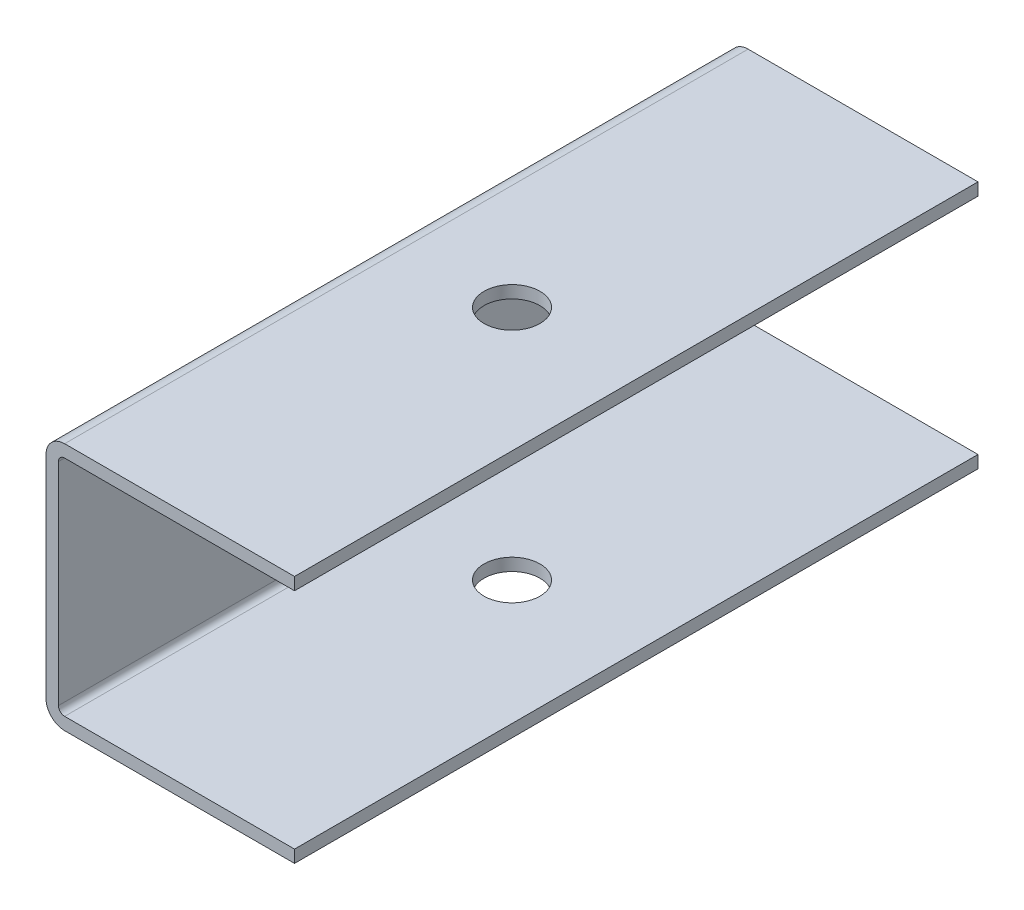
ISO-10303-21;
HEADER;
FILE_DESCRIPTION(('STEP AP214'),'2;1');
FILE_NAME('part.step','',(''),(''),'','','');
FILE_SCHEMA(('AUTOMOTIVE_DESIGN { 1 0 10303 214 1 1 1 1 }'));
ENDSEC;
DATA;
#1=APPLICATION_CONTEXT('core data for automotive mechanical design processes');
#2=APPLICATION_PROTOCOL_DEFINITION('international standard','automotive_design',2000,#1);
#3=PRODUCT_CONTEXT('',#1,'mechanical');
#4=PRODUCT('Part','Part','',(#3));
#5=PRODUCT_RELATED_PRODUCT_CATEGORY('part','',(#4));
#6=PRODUCT_DEFINITION_FORMATION('','',#4);
#7=PRODUCT_DEFINITION_CONTEXT('part definition',#1,'design');
#8=PRODUCT_DEFINITION('design','',#6,#7);
#9=PRODUCT_DEFINITION_SHAPE('','',#8);
#10=(LENGTH_UNIT() NAMED_UNIT(*) SI_UNIT(.MILLI.,.METRE.));
#11=(NAMED_UNIT(*) PLANE_ANGLE_UNIT() SI_UNIT($,.RADIAN.));
#12=(NAMED_UNIT(*) SI_UNIT($,.STERADIAN.) SOLID_ANGLE_UNIT());
#13=UNCERTAINTY_MEASURE_WITH_UNIT(LENGTH_MEASURE(1.E-05),#10,'distance_accuracy_value','');
#14=(GEOMETRIC_REPRESENTATION_CONTEXT(3) GLOBAL_UNCERTAINTY_ASSIGNED_CONTEXT((#13)) GLOBAL_UNIT_ASSIGNED_CONTEXT((#10,
#11,#12)) REPRESENTATION_CONTEXT('',''));
#15=CARTESIAN_POINT('',(0.,0.,0.));
#16=DIRECTION('',(0.,0.,1.));
#17=DIRECTION('',(1.,0.,0.));
#18=AXIS2_PLACEMENT_3D('',#15,#16,#17);
#19=CARTESIAN_POINT('',(40.,-38.,110.));
#20=DIRECTION('',(-1.,0.,0.));
#21=DIRECTION('',(0.,0.,1.));
#22=AXIS2_PLACEMENT_3D('',#19,#20,#21);
#23=PLANE('',#22);
#24=DIRECTION('',(0.,1.,0.));
#25=VECTOR('',#24,1.);
#26=CARTESIAN_POINT('',(40.,-38.,0.));
#27=LINE('',#26,#25);
#28=CARTESIAN_POINT('',(40.,-40.,0.));
#29=VERTEX_POINT('',#28);
#30=CARTESIAN_POINT('',(40.,-38.,0.));
#31=VERTEX_POINT('',#30);
#32=EDGE_CURVE('E121',#29,#31,#27,.T.);
#33=ORIENTED_EDGE('',*,*,#32,.T.);
#34=DIRECTION('',(0.,0.,-1.));
#35=VECTOR('',#34,1.);
#36=CARTESIAN_POINT('',(40.,-38.,110.));
#37=LINE('',#36,#35);
#38=CARTESIAN_POINT('',(40.,-38.,110.));
#39=VERTEX_POINT('',#38);
#40=EDGE_CURVE('E11',#39,#31,#37,.T.);
#41=ORIENTED_EDGE('',*,*,#40,.F.);
#42=DIRECTION('',(0.,1.,0.));
#43=VECTOR('',#42,1.);
#44=CARTESIAN_POINT('',(40.,-38.,110.));
#45=LINE('',#44,#43);
#46=CARTESIAN_POINT('',(40.,-40.,110.));
#47=VERTEX_POINT('',#46);
#48=EDGE_CURVE('E161',#47,#39,#45,.T.);
#49=ORIENTED_EDGE('',*,*,#48,.F.);
#50=DIRECTION('',(0.,0.,-1.));
#51=VECTOR('',#50,1.);
#52=CARTESIAN_POINT('',(40.,-40.,110.));
#53=LINE('',#52,#51);
#54=EDGE_CURVE('E134',#47,#29,#53,.T.);
#55=ORIENTED_EDGE('',*,*,#54,.T.);
#56=EDGE_LOOP('',(#33,#41,#49,#55));
#57=FACE_BOUND('',#56,.T.);
#58=ADVANCED_FACE('F29',(#57),#23,.F.);
#59=CARTESIAN_POINT('',(3.,-38.,110.));
#60=DIRECTION('',(0.,-1.,0.));
#61=DIRECTION('',(0.,0.,-1.));
#62=AXIS2_PLACEMENT_3D('',#59,#60,#61);
#63=PLANE('',#62);
#64=CARTESIAN_POINT('',(20.,-38.,55.));
#65=DIRECTION('',(0.,-1.,0.));
#66=DIRECTION('',(0.,0.,-1.));
#67=AXIS2_PLACEMENT_3D('',#64,#65,#66);
#68=CIRCLE('',#67,4.50000000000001);
#69=CARTESIAN_POINT('',(20.,-38.,50.5));
#70=VERTEX_POINT('',#69);
#71=EDGE_CURVE('E135',#70,#70,#68,.T.);
#72=ORIENTED_EDGE('',*,*,#71,.T.);
#73=EDGE_LOOP('',(#72));
#74=FACE_BOUND('',#73,.T.);
#75=DIRECTION('',(-1.,0.,0.));
#76=VECTOR('',#75,1.);
#77=CARTESIAN_POINT('',(3.,-38.,0.));
#78=LINE('',#77,#76);
#79=CARTESIAN_POINT('',(3.,-38.,0.));
#80=VERTEX_POINT('',#79);
#81=EDGE_CURVE('E117',#31,#80,#78,.T.);
#82=ORIENTED_EDGE('',*,*,#81,.T.);
#83=DIRECTION('',(0.,0.,-1.));
#84=VECTOR('',#83,1.);
#85=CARTESIAN_POINT('',(3.,-38.,110.));
#86=LINE('',#85,#84);
#87=CARTESIAN_POINT('',(3.,-38.,110.));
#88=VERTEX_POINT('',#87);
#89=EDGE_CURVE('E36',#88,#80,#86,.T.);
#90=ORIENTED_EDGE('',*,*,#89,.F.);
#91=DIRECTION('',(-1.,0.,0.));
#92=VECTOR('',#91,1.);
#93=CARTESIAN_POINT('',(3.,-38.,110.));
#94=LINE('',#93,#92);
#95=EDGE_CURVE('E130',#39,#88,#94,.T.);
#96=ORIENTED_EDGE('',*,*,#95,.F.);
#97=ORIENTED_EDGE('',*,*,#40,.T.);
#98=EDGE_LOOP('',(#82,#90,#96,#97));
#99=FACE_BOUND('',#98,.T.);
#100=ADVANCED_FACE('F129',(#74,#99),#63,.F.);
#101=CARTESIAN_POINT('',(3.,-37.,110.));
#102=DIRECTION('',(0.,0.,-1.));
#103=DIRECTION('',(-1.,0.,0.));
#104=AXIS2_PLACEMENT_3D('',#101,#102,#103);
#105=CYLINDRICAL_SURFACE('',#104,1.);
#106=CARTESIAN_POINT('',(3.,-37.,0.));
#107=DIRECTION('',(0.,0.,-1.));
#108=DIRECTION('',(-1.,0.,0.));
#109=AXIS2_PLACEMENT_3D('',#106,#107,#108);
#110=CIRCLE('',#109,1.);
#111=CARTESIAN_POINT('',(2.,-37.,0.));
#112=VERTEX_POINT('',#111);
#113=EDGE_CURVE('E123',#80,#112,#110,.T.);
#114=ORIENTED_EDGE('',*,*,#113,.T.);
#115=DIRECTION('',(0.,0.,-1.));
#116=VECTOR('',#115,1.);
#117=CARTESIAN_POINT('',(2.,-37.,110.));
#118=LINE('',#117,#116);
#119=CARTESIAN_POINT('',(2.,-37.,110.));
#120=VERTEX_POINT('',#119);
#121=EDGE_CURVE('E207',#120,#112,#118,.T.);
#122=ORIENTED_EDGE('',*,*,#121,.F.);
#123=CARTESIAN_POINT('',(3.,-37.,110.));
#124=DIRECTION('',(0.,0.,-1.));
#125=DIRECTION('',(-1.,0.,0.));
#126=AXIS2_PLACEMENT_3D('',#123,#124,#125);
#127=CIRCLE('',#126,1.);
#128=EDGE_CURVE('E164',#88,#120,#127,.T.);
#129=ORIENTED_EDGE('',*,*,#128,.F.);
#130=ORIENTED_EDGE('',*,*,#89,.T.);
#131=EDGE_LOOP('',(#114,#122,#129,#130));
#132=FACE_BOUND('',#131,.T.);
#133=ADVANCED_FACE('F211',(#132),#105,.F.);
#134=CARTESIAN_POINT('',(2.,-3.,110.));
#135=DIRECTION('',(-1.,0.,0.));
#136=DIRECTION('',(0.,-1.,0.));
#137=AXIS2_PLACEMENT_3D('',#134,#135,#136);
#138=PLANE('',#137);
#139=DIRECTION('',(0.,1.,0.));
#140=VECTOR('',#139,1.);
#141=CARTESIAN_POINT('',(2.,-3.,0.));
#142=LINE('',#141,#140);
#143=CARTESIAN_POINT('',(2.,-3.,0.));
#144=VERTEX_POINT('',#143);
#145=EDGE_CURVE('E143',#112,#144,#142,.T.);
#146=ORIENTED_EDGE('',*,*,#145,.T.);
#147=DIRECTION('',(0.,0.,-1.));
#148=VECTOR('',#147,1.);
#149=CARTESIAN_POINT('',(2.,-3.,110.));
#150=LINE('',#149,#148);
#151=CARTESIAN_POINT('',(2.,-3.,110.));
#152=VERTEX_POINT('',#151);
#153=EDGE_CURVE('E204',#152,#144,#150,.T.);
#154=ORIENTED_EDGE('',*,*,#153,.F.);
#155=DIRECTION('',(0.,1.,0.));
#156=VECTOR('',#155,1.);
#157=CARTESIAN_POINT('',(2.,-3.,110.));
#158=LINE('',#157,#156);
#159=EDGE_CURVE('E166',#120,#152,#158,.T.);
#160=ORIENTED_EDGE('',*,*,#159,.F.);
#161=ORIENTED_EDGE('',*,*,#121,.T.);
#162=EDGE_LOOP('',(#146,#154,#160,#161));
#163=FACE_BOUND('',#162,.T.);
#164=ADVANCED_FACE('F219',(#163),#138,.F.);
#165=CARTESIAN_POINT('',(3.,-3.,110.));
#166=DIRECTION('',(0.,0.,-1.));
#167=DIRECTION('',(-1.,0.,0.));
#168=AXIS2_PLACEMENT_3D('',#165,#166,#167);
#169=CYLINDRICAL_SURFACE('',#168,1.);
#170=CARTESIAN_POINT('',(3.,-3.,0.));
#171=DIRECTION('',(0.,0.,-1.));
#172=DIRECTION('',(-1.,0.,0.));
#173=AXIS2_PLACEMENT_3D('',#170,#171,#172);
#174=CIRCLE('',#173,1.);
#175=CARTESIAN_POINT('',(3.,-2.,0.));
#176=VERTEX_POINT('',#175);
#177=EDGE_CURVE('E145',#144,#176,#174,.T.);
#178=ORIENTED_EDGE('',*,*,#177,.T.);
#179=DIRECTION('',(0.,0.,-1.));
#180=VECTOR('',#179,1.);
#181=CARTESIAN_POINT('',(3.,-2.,110.));
#182=LINE('',#181,#180);
#183=CARTESIAN_POINT('',(3.,-2.,110.));
#184=VERTEX_POINT('',#183);
#185=EDGE_CURVE('E201',#184,#176,#182,.T.);
#186=ORIENTED_EDGE('',*,*,#185,.F.);
#187=CARTESIAN_POINT('',(3.,-3.,110.));
#188=DIRECTION('',(0.,0.,-1.));
#189=DIRECTION('',(-1.,0.,0.));
#190=AXIS2_PLACEMENT_3D('',#187,#188,#189);
#191=CIRCLE('',#190,1.);
#192=EDGE_CURVE('E168',#152,#184,#191,.T.);
#193=ORIENTED_EDGE('',*,*,#192,.F.);
#194=ORIENTED_EDGE('',*,*,#153,.T.);
#195=EDGE_LOOP('',(#178,#186,#193,#194));
#196=FACE_BOUND('',#195,.T.);
#197=ADVANCED_FACE('F222',(#196),#169,.F.);
#198=CARTESIAN_POINT('',(3.,-2.,110.));
#199=DIRECTION('',(0.,1.,0.));
#200=DIRECTION('',(-1.,0.,0.));
#201=AXIS2_PLACEMENT_3D('',#198,#199,#200);
#202=PLANE('',#201);
#203=CARTESIAN_POINT('',(20.,-2.,55.));
#204=DIRECTION('',(0.,1.,0.));
#205=DIRECTION('',(-1.,0.,0.));
#206=AXIS2_PLACEMENT_3D('',#203,#204,#205);
#207=CIRCLE('',#206,4.50000000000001);
#208=CARTESIAN_POINT('',(15.5,-2.,55.));
#209=VERTEX_POINT('',#208);
#210=EDGE_CURVE('E138',#209,#209,#207,.T.);
#211=ORIENTED_EDGE('',*,*,#210,.T.);
#212=EDGE_LOOP('',(#211));
#213=FACE_BOUND('',#212,.T.);
#214=DIRECTION('',(1.,0.,0.));
#215=VECTOR('',#214,1.);
#216=CARTESIAN_POINT('',(3.,-2.,0.));
#217=LINE('',#216,#215);
#218=CARTESIAN_POINT('',(40.,-2.,0.));
#219=VERTEX_POINT('',#218);
#220=EDGE_CURVE('E147',#176,#219,#217,.T.);
#221=ORIENTED_EDGE('',*,*,#220,.T.);
#222=DIRECTION('',(0.,0.,-1.));
#223=VECTOR('',#222,1.);
#224=CARTESIAN_POINT('',(40.,-2.,110.));
#225=LINE('',#224,#223);
#226=CARTESIAN_POINT('',(40.,-2.,110.));
#227=VERTEX_POINT('',#226);
#228=EDGE_CURVE('E198',#227,#219,#225,.T.);
#229=ORIENTED_EDGE('',*,*,#228,.F.);
#230=DIRECTION('',(1.,0.,0.));
#231=VECTOR('',#230,1.);
#232=CARTESIAN_POINT('',(3.,-2.,110.));
#233=LINE('',#232,#231);
#234=EDGE_CURVE('E170',#184,#227,#233,.T.);
#235=ORIENTED_EDGE('',*,*,#234,.F.);
#236=ORIENTED_EDGE('',*,*,#185,.T.);
#237=EDGE_LOOP('',(#221,#229,#235,#236));
#238=FACE_BOUND('',#237,.T.);
#239=ADVANCED_FACE('F227',(#213,#238),#202,.F.);
#240=CARTESIAN_POINT('',(40.,0.,110.));
#241=DIRECTION('',(-1.,0.,0.));
#242=DIRECTION('',(0.,0.,1.));
#243=AXIS2_PLACEMENT_3D('',#240,#241,#242);
#244=PLANE('',#243);
#245=DIRECTION('',(0.,1.,0.));
#246=VECTOR('',#245,1.);
#247=CARTESIAN_POINT('',(40.,0.,0.));
#248=LINE('',#247,#246);
#249=CARTESIAN_POINT('',(40.,0.,0.));
#250=VERTEX_POINT('',#249);
#251=EDGE_CURVE('E149',#219,#250,#248,.T.);
#252=ORIENTED_EDGE('',*,*,#251,.T.);
#253=DIRECTION('',(0.,0.,-1.));
#254=VECTOR('',#253,1.);
#255=CARTESIAN_POINT('',(40.,0.,110.));
#256=LINE('',#255,#254);
#257=CARTESIAN_POINT('',(40.,0.,110.));
#258=VERTEX_POINT('',#257);
#259=EDGE_CURVE('E195',#258,#250,#256,.T.);
#260=ORIENTED_EDGE('',*,*,#259,.F.);
#261=DIRECTION('',(0.,1.,0.));
#262=VECTOR('',#261,1.);
#263=CARTESIAN_POINT('',(40.,0.,110.));
#264=LINE('',#263,#262);
#265=EDGE_CURVE('E172',#227,#258,#264,.T.);
#266=ORIENTED_EDGE('',*,*,#265,.F.);
#267=ORIENTED_EDGE('',*,*,#228,.T.);
#268=EDGE_LOOP('',(#252,#260,#266,#267));
#269=FACE_BOUND('',#268,.T.);
#270=ADVANCED_FACE('F233',(#269),#244,.F.);
#271=CARTESIAN_POINT('',(3.,0.,110.));
#272=DIRECTION('',(0.,-1.,0.));
#273=DIRECTION('',(0.,0.,-1.));
#274=AXIS2_PLACEMENT_3D('',#271,#272,#273);
#275=PLANE('',#274);
#276=CARTESIAN_POINT('',(20.,0.,55.));
#277=DIRECTION('',(0.,1.,0.));
#278=DIRECTION('',(0.,0.,1.));
#279=AXIS2_PLACEMENT_3D('',#276,#277,#278);
#280=CIRCLE('',#279,4.50000000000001);
#281=CARTESIAN_POINT('',(20.,0.,59.5));
#282=VERTEX_POINT('',#281);
#283=EDGE_CURVE('E340',#282,#282,#280,.T.);
#284=ORIENTED_EDGE('',*,*,#283,.F.);
#285=EDGE_LOOP('',(#284));
#286=FACE_BOUND('',#285,.T.);
#287=DIRECTION('',(-1.,0.,0.));
#288=VECTOR('',#287,1.);
#289=CARTESIAN_POINT('',(3.,0.,0.));
#290=LINE('',#289,#288);
#291=CARTESIAN_POINT('',(3.,0.,0.));
#292=VERTEX_POINT('',#291);
#293=EDGE_CURVE('E151',#250,#292,#290,.T.);
#294=ORIENTED_EDGE('',*,*,#293,.T.);
#295=DIRECTION('',(0.,0.,-1.));
#296=VECTOR('',#295,1.);
#297=CARTESIAN_POINT('',(3.,0.,110.));
#298=LINE('',#297,#296);
#299=CARTESIAN_POINT('',(3.,0.,110.));
#300=VERTEX_POINT('',#299);
#301=EDGE_CURVE('E192',#300,#292,#298,.T.);
#302=ORIENTED_EDGE('',*,*,#301,.F.);
#303=DIRECTION('',(-1.,0.,0.));
#304=VECTOR('',#303,1.);
#305=CARTESIAN_POINT('',(3.,0.,110.));
#306=LINE('',#305,#304);
#307=EDGE_CURVE('E174',#258,#300,#306,.T.);
#308=ORIENTED_EDGE('',*,*,#307,.F.);
#309=ORIENTED_EDGE('',*,*,#259,.T.);
#310=EDGE_LOOP('',(#294,#302,#308,#309));
#311=FACE_BOUND('',#310,.T.);
#312=ADVANCED_FACE('F237',(#286,#311),#275,.F.);
#313=CARTESIAN_POINT('',(3.,-3.,110.));
#314=DIRECTION('',(0.,0.,-1.));
#315=DIRECTION('',(-1.,0.,0.));
#316=AXIS2_PLACEMENT_3D('',#313,#314,#315);
#317=CYLINDRICAL_SURFACE('',#316,3.);
#318=CARTESIAN_POINT('',(3.,-3.,0.));
#319=DIRECTION('',(0.,0.,1.));
#320=DIRECTION('',(-1.,0.,0.));
#321=AXIS2_PLACEMENT_3D('',#318,#319,#320);
#322=CIRCLE('',#321,3.);
#323=CARTESIAN_POINT('',(0.,-3.,0.));
#324=VERTEX_POINT('',#323);
#325=EDGE_CURVE('E153',#292,#324,#322,.T.);
#326=ORIENTED_EDGE('',*,*,#325,.T.);
#327=DIRECTION('',(0.,0.,-1.));
#328=VECTOR('',#327,1.);
#329=CARTESIAN_POINT('',(0.,-3.,110.));
#330=LINE('',#329,#328);
#331=CARTESIAN_POINT('',(0.,-3.,110.));
#332=VERTEX_POINT('',#331);
#333=EDGE_CURVE('E189',#332,#324,#330,.T.);
#334=ORIENTED_EDGE('',*,*,#333,.F.);
#335=CARTESIAN_POINT('',(3.,-3.,110.));
#336=DIRECTION('',(0.,0.,1.));
#337=DIRECTION('',(-1.,0.,0.));
#338=AXIS2_PLACEMENT_3D('',#335,#336,#337);
#339=CIRCLE('',#338,3.);
#340=EDGE_CURVE('E176',#300,#332,#339,.T.);
#341=ORIENTED_EDGE('',*,*,#340,.F.);
#342=ORIENTED_EDGE('',*,*,#301,.T.);
#343=EDGE_LOOP('',(#326,#334,#341,#342));
#344=FACE_BOUND('',#343,.T.);
#345=ADVANCED_FACE('F242',(#344),#317,.T.);
#346=CARTESIAN_POINT('',(0.,-3.,110.));
#347=DIRECTION('',(1.,0.,0.));
#348=DIRECTION('',(0.,1.,0.));
#349=AXIS2_PLACEMENT_3D('',#346,#347,#348);
#350=PLANE('',#349);
#351=DIRECTION('',(0.,-1.,0.));
#352=VECTOR('',#351,1.);
#353=CARTESIAN_POINT('',(0.,-3.,0.));
#354=LINE('',#353,#352);
#355=CARTESIAN_POINT('',(0.,-37.,0.));
#356=VERTEX_POINT('',#355);
#357=EDGE_CURVE('E155',#324,#356,#354,.T.);
#358=ORIENTED_EDGE('',*,*,#357,.T.);
#359=DIRECTION('',(0.,0.,-1.));
#360=VECTOR('',#359,1.);
#361=CARTESIAN_POINT('',(0.,-37.,110.));
#362=LINE('',#361,#360);
#363=CARTESIAN_POINT('',(0.,-37.,110.));
#364=VERTEX_POINT('',#363);
#365=EDGE_CURVE('E186',#364,#356,#362,.T.);
#366=ORIENTED_EDGE('',*,*,#365,.F.);
#367=DIRECTION('',(0.,-1.,0.));
#368=VECTOR('',#367,1.);
#369=CARTESIAN_POINT('',(0.,-3.,110.));
#370=LINE('',#369,#368);
#371=EDGE_CURVE('E178',#332,#364,#370,.T.);
#372=ORIENTED_EDGE('',*,*,#371,.F.);
#373=ORIENTED_EDGE('',*,*,#333,.T.);
#374=EDGE_LOOP('',(#358,#366,#372,#373));
#375=FACE_BOUND('',#374,.T.);
#376=ADVANCED_FACE('F246',(#375),#350,.F.);
#377=CARTESIAN_POINT('',(3.,-37.,110.));
#378=DIRECTION('',(0.,0.,-1.));
#379=DIRECTION('',(-1.,0.,0.));
#380=AXIS2_PLACEMENT_3D('',#377,#378,#379);
#381=CYLINDRICAL_SURFACE('',#380,3.);
#382=CARTESIAN_POINT('',(3.,-37.,0.));
#383=DIRECTION('',(0.,0.,1.));
#384=DIRECTION('',(-1.,0.,0.));
#385=AXIS2_PLACEMENT_3D('',#382,#383,#384);
#386=CIRCLE('',#385,3.);
#387=CARTESIAN_POINT('',(3.,-40.,0.));
#388=VERTEX_POINT('',#387);
#389=EDGE_CURVE('E157',#356,#388,#386,.T.);
#390=ORIENTED_EDGE('',*,*,#389,.T.);
#391=DIRECTION('',(0.,0.,-1.));
#392=VECTOR('',#391,1.);
#393=CARTESIAN_POINT('',(3.,-40.,110.));
#394=LINE('',#393,#392);
#395=CARTESIAN_POINT('',(3.,-40.,110.));
#396=VERTEX_POINT('',#395);
#397=EDGE_CURVE('E183',#396,#388,#394,.T.);
#398=ORIENTED_EDGE('',*,*,#397,.F.);
#399=CARTESIAN_POINT('',(3.,-37.,110.));
#400=DIRECTION('',(0.,0.,1.));
#401=DIRECTION('',(-1.,0.,0.));
#402=AXIS2_PLACEMENT_3D('',#399,#400,#401);
#403=CIRCLE('',#402,3.);
#404=EDGE_CURVE('E48',#364,#396,#403,.T.);
#405=ORIENTED_EDGE('',*,*,#404,.F.);
#406=ORIENTED_EDGE('',*,*,#365,.T.);
#407=EDGE_LOOP('',(#390,#398,#405,#406));
#408=FACE_BOUND('',#407,.T.);
#409=ADVANCED_FACE('F250',(#408),#381,.T.);
#410=CARTESIAN_POINT('',(3.,-40.,110.));
#411=DIRECTION('',(0.,1.,0.));
#412=DIRECTION('',(0.,0.,1.));
#413=AXIS2_PLACEMENT_3D('',#410,#411,#412);
#414=PLANE('',#413);
#415=CARTESIAN_POINT('',(20.,-40.,55.));
#416=DIRECTION('',(0.,1.,0.));
#417=DIRECTION('',(0.,0.,1.));
#418=AXIS2_PLACEMENT_3D('',#415,#416,#417);
#419=CIRCLE('',#418,4.50000000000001);
#420=CARTESIAN_POINT('',(20.,-40.,59.5));
#421=VERTEX_POINT('',#420);
#422=EDGE_CURVE('E343',#421,#421,#419,.T.);
#423=ORIENTED_EDGE('',*,*,#422,.T.);
#424=EDGE_LOOP('',(#423));
#425=FACE_BOUND('',#424,.T.);
#426=DIRECTION('',(1.,0.,0.));
#427=VECTOR('',#426,1.);
#428=CARTESIAN_POINT('',(3.,-40.,0.));
#429=LINE('',#428,#427);
#430=EDGE_CURVE('E159',#388,#29,#429,.T.);
#431=ORIENTED_EDGE('',*,*,#430,.T.);
#432=ORIENTED_EDGE('',*,*,#54,.F.);
#433=DIRECTION('',(1.,0.,0.));
#434=VECTOR('',#433,1.);
#435=CARTESIAN_POINT('',(3.,-40.,110.));
#436=LINE('',#435,#434);
#437=EDGE_CURVE('E43',#396,#47,#436,.T.);
#438=ORIENTED_EDGE('',*,*,#437,.F.);
#439=ORIENTED_EDGE('',*,*,#397,.T.);
#440=EDGE_LOOP('',(#431,#432,#438,#439));
#441=FACE_BOUND('',#440,.T.);
#442=ADVANCED_FACE('F252',(#425,#441),#414,.F.);
#443=CARTESIAN_POINT('',(3.,-37.,110.));
#444=DIRECTION('',(0.,0.,-1.));
#445=DIRECTION('',(-1.,0.,0.));
#446=AXIS2_PLACEMENT_3D('',#443,#444,#445);
#447=PLANE('',#446);
#448=ORIENTED_EDGE('',*,*,#48,.T.);
#449=ORIENTED_EDGE('',*,*,#95,.T.);
#450=ORIENTED_EDGE('',*,*,#128,.T.);
#451=ORIENTED_EDGE('',*,*,#159,.T.);
#452=ORIENTED_EDGE('',*,*,#192,.T.);
#453=ORIENTED_EDGE('',*,*,#234,.T.);
#454=ORIENTED_EDGE('',*,*,#265,.T.);
#455=ORIENTED_EDGE('',*,*,#307,.T.);
#456=ORIENTED_EDGE('',*,*,#340,.T.);
#457=ORIENTED_EDGE('',*,*,#371,.T.);
#458=ORIENTED_EDGE('',*,*,#404,.T.);
#459=ORIENTED_EDGE('',*,*,#437,.T.);
#460=EDGE_LOOP('',(#448,#449,#450,#451,#452,#453,#454,#455,#456,#457,#458,#459));
#461=FACE_BOUND('',#460,.T.);
#462=ADVANCED_FACE('F214',(#461),#447,.F.);
#463=CARTESIAN_POINT('',(3.,-37.,0.));
#464=DIRECTION('',(0.,0.,-1.));
#465=DIRECTION('',(-1.,0.,0.));
#466=AXIS2_PLACEMENT_3D('',#463,#464,#465);
#467=PLANE('',#466);
#468=ORIENTED_EDGE('',*,*,#32,.F.);
#469=ORIENTED_EDGE('',*,*,#430,.F.);
#470=ORIENTED_EDGE('',*,*,#389,.F.);
#471=ORIENTED_EDGE('',*,*,#357,.F.);
#472=ORIENTED_EDGE('',*,*,#325,.F.);
#473=ORIENTED_EDGE('',*,*,#293,.F.);
#474=ORIENTED_EDGE('',*,*,#251,.F.);
#475=ORIENTED_EDGE('',*,*,#220,.F.);
#476=ORIENTED_EDGE('',*,*,#177,.F.);
#477=ORIENTED_EDGE('',*,*,#145,.F.);
#478=ORIENTED_EDGE('',*,*,#113,.F.);
#479=ORIENTED_EDGE('',*,*,#81,.F.);
#480=EDGE_LOOP('',(#468,#469,#470,#471,#472,#473,#474,#475,#476,#477,#478,#479));
#481=FACE_BOUND('',#480,.T.);
#482=ADVANCED_FACE('F118',(#481),#467,.T.);
#483=CARTESIAN_POINT('',(20.,-40.,55.));
#484=DIRECTION('',(0.,1.,0.));
#485=DIRECTION('',(0.,0.,1.));
#486=AXIS2_PLACEMENT_3D('',#483,#484,#485);
#487=CYLINDRICAL_SURFACE('',#486,4.50000000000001);
#488=ORIENTED_EDGE('',*,*,#422,.F.);
#489=EDGE_LOOP('',(#488));
#490=FACE_BOUND('',#489,.T.);
#491=ORIENTED_EDGE('',*,*,#71,.F.);
#492=EDGE_LOOP('',(#491));
#493=FACE_BOUND('',#492,.T.);
#494=ADVANCED_FACE('F315',(#490,#493),#487,.F.);
#495=ORIENTED_EDGE('',*,*,#283,.T.);
#496=EDGE_LOOP('',(#495));
#497=FACE_BOUND('',#496,.T.);
#498=ORIENTED_EDGE('',*,*,#210,.F.);
#499=EDGE_LOOP('',(#498));
#500=FACE_BOUND('',#499,.T.);
#501=ADVANCED_FACE('F324',(#497,#500),#487,.F.);
#502=CLOSED_SHELL('',(#58,#100,#133,#164,#197,#239,#270,#312,#345,#376,#409,#442,#462,#482,#494,#501));
#503=MANIFOLD_SOLID_BREP('B2',#502);
#504=ADVANCED_BREP_SHAPE_REPRESENTATION('',(#18,#503),#14);
#505=SHAPE_DEFINITION_REPRESENTATION(#9,#504);
ENDSEC;
END-ISO-10303-21;
